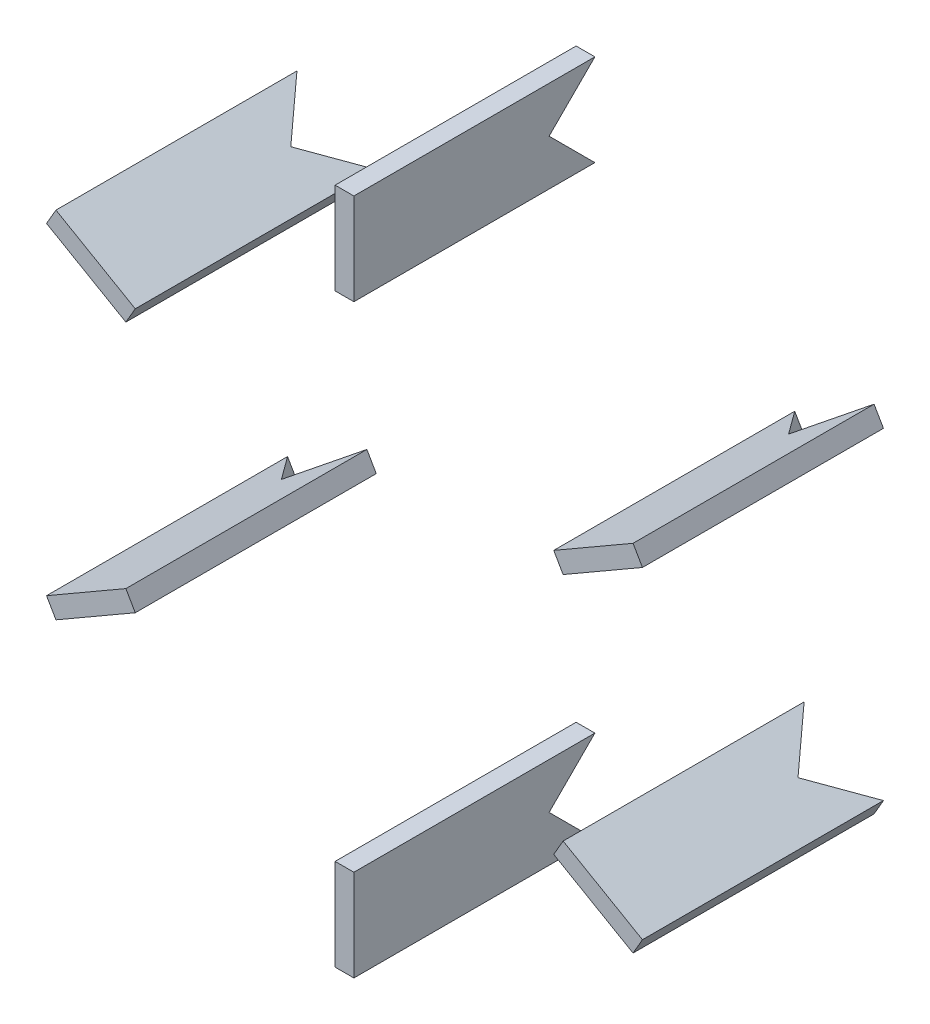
ISO-10303-21;
HEADER;
FILE_DESCRIPTION(('STEP AP214'),'2;1');
FILE_NAME('part.step','',(''),(''),'','','');
FILE_SCHEMA(('AUTOMOTIVE_DESIGN { 1 0 10303 214 1 1 1 1 }'));
ENDSEC;
DATA;
#1=APPLICATION_CONTEXT('core data for automotive mechanical design processes');
#2=APPLICATION_PROTOCOL_DEFINITION('international standard','automotive_design',2000,#1);
#3=PRODUCT_CONTEXT('',#1,'mechanical');
#4=PRODUCT('Part','Part','',(#3));
#5=PRODUCT_RELATED_PRODUCT_CATEGORY('part','',(#4));
#6=PRODUCT_DEFINITION_FORMATION('','',#4);
#7=PRODUCT_DEFINITION_CONTEXT('part definition',#1,'design');
#8=PRODUCT_DEFINITION('design','',#6,#7);
#9=PRODUCT_DEFINITION_SHAPE('','',#8);
#10=(LENGTH_UNIT() NAMED_UNIT(*) SI_UNIT(.MILLI.,.METRE.));
#11=(NAMED_UNIT(*) PLANE_ANGLE_UNIT() SI_UNIT($,.RADIAN.));
#12=(NAMED_UNIT(*) SI_UNIT($,.STERADIAN.) SOLID_ANGLE_UNIT());
#13=UNCERTAINTY_MEASURE_WITH_UNIT(LENGTH_MEASURE(1.E-05),#10,'distance_accuracy_value','');
#14=(GEOMETRIC_REPRESENTATION_CONTEXT(3) GLOBAL_UNCERTAINTY_ASSIGNED_CONTEXT((#13)) GLOBAL_UNIT_ASSIGNED_CONTEXT((#10,
#11,#12)) REPRESENTATION_CONTEXT('',''));
#15=CARTESIAN_POINT('',(0.,0.,0.));
#16=DIRECTION('',(0.,0.,1.));
#17=DIRECTION('',(1.,0.,0.));
#18=AXIS2_PLACEMENT_3D('',#15,#16,#17);
#19=CARTESIAN_POINT('',(0.625,-1.08253175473,0.));
#20=DIRECTION('',(0.50000000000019,-0.866025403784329,0.));
#21=DIRECTION('',(0.866025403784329,0.50000000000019,0.));
#22=AXIS2_PLACEMENT_3D('',#19,#20,#21);
#23=PLANE('',#22);
#24=DIRECTION('',(0.,0.,1.));
#25=VECTOR('',#24,1.);
#26=CARTESIAN_POINT('',(39.682745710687,21.4674682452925,1.895));
#27=LINE('',#26,#25);
#28=CARTESIAN_POINT('',(39.6827457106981,21.4674682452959,33.994));
#29=VERTEX_POINT('',#28);
#30=CARTESIAN_POINT('',(39.682745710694,21.467468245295,1.89499999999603));
#31=VERTEX_POINT('',#30);
#32=EDGE_CURVE('P0_E88',#29,#31,#27,.F.);
#33=ORIENTED_EDGE('',*,*,#32,.F.);
#34=DIRECTION('',(-0.86602540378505,-0.499999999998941,0.));
#35=VECTOR('',#34,1.);
#36=CARTESIAN_POINT('',(39.6827457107,21.4674682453,33.994));
#37=LINE('',#36,#35);
#38=CARTESIAN_POINT('',(29.1172357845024,15.3674682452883,33.994));
#39=VERTEX_POINT('',#38);
#40=EDGE_CURVE('P0_E60',#29,#39,#37,.T.);
#41=ORIENTED_EDGE('',*,*,#40,.T.);
#42=DIRECTION('',(0.,0.,1.));
#43=VECTOR('',#42,1.);
#44=CARTESIAN_POINT('',(29.117235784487,15.3674682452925,33.994));
#45=LINE('',#44,#43);
#46=CARTESIAN_POINT('',(29.1172357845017,15.3674682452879,1.89500000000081));
#47=VERTEX_POINT('',#46);
#48=EDGE_CURVE('P0_E56',#47,#39,#45,.T.);
#49=ORIENTED_EDGE('',*,*,#48,.F.);
#50=DIRECTION('',(0.612372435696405,0.353553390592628,0.707106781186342));
#51=VECTOR('',#50,1.);
#52=CARTESIAN_POINT('',(29.1172357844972,15.3674682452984,1.89500000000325));
#53=LINE('',#52,#51);
#54=CARTESIAN_POINT('',(34.3999907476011,18.4174682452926,7.99500000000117));
#55=VERTEX_POINT('',#54);
#56=EDGE_CURVE('P0_E73',#47,#55,#53,.T.);
#57=ORIENTED_EDGE('',*,*,#56,.T.);
#58=DIRECTION('',(0.612372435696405,0.353553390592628,-0.707106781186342));
#59=VECTOR('',#58,1.);
#60=CARTESIAN_POINT('',(34.3999907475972,18.4174682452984,7.99499999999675));
#61=LINE('',#60,#59);
#62=EDGE_CURVE('P0_E82',#55,#31,#61,.T.);
#63=ORIENTED_EDGE('',*,*,#62,.T.);
#64=EDGE_LOOP('',(#33,#41,#49,#57,#63));
#65=FACE_BOUND('',#64,.T.);
#66=ADVANCED_FACE('P0_F16',(#65),#23,.T.);
#67=CARTESIAN_POINT('',(28.4922357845,16.45,33.994));
#68=DIRECTION('',(-0.866025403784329,-0.50000000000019,0.));
#69=DIRECTION('',(0.50000000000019,-0.866025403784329,0.));
#70=AXIS2_PLACEMENT_3D('',#67,#68,#69);
#71=PLANE('',#70);
#72=DIRECTION('',(0.500000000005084,-0.866025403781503,6.3505624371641E-12));
#73=VECTOR('',#72,1.);
#74=CARTESIAN_POINT('',(27.8672357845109,17.5325317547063,1.89499999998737));
#75=LINE('',#74,#73);
#76=CARTESIAN_POINT('',(27.8672357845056,17.5325317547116,1.89499999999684));
#77=VERTEX_POINT('',#76);
#78=EDGE_CURVE('P0_E76',#77,#47,#75,.T.);
#79=ORIENTED_EDGE('',*,*,#78,.T.);
#80=ORIENTED_EDGE('',*,*,#48,.T.);
#81=DIRECTION('',(-0.500000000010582,0.866025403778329,0.));
#82=VECTOR('',#81,1.);
#83=CARTESIAN_POINT('',(29.1172357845,15.3674682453,33.994));
#84=LINE('',#83,#82);
#85=CARTESIAN_POINT('',(27.8672357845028,17.5325317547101,33.994));
#86=VERTEX_POINT('',#85);
#87=EDGE_CURVE('P0_E93',#39,#86,#84,.T.);
#88=ORIENTED_EDGE('',*,*,#87,.T.);
#89=DIRECTION('',(0.,0.,1.));
#90=VECTOR('',#89,1.);
#91=CARTESIAN_POINT('',(27.8672357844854,17.5325317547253,0.));
#92=LINE('',#91,#90);
#93=EDGE_CURVE('P0_E20',#86,#77,#92,.F.);
#94=ORIENTED_EDGE('',*,*,#93,.T.);
#95=EDGE_LOOP('',(#79,#80,#88,#94));
#96=FACE_BOUND('',#95,.T.);
#97=ADVANCED_FACE('P0_F81',(#96),#71,.T.);
#98=CARTESIAN_POINT('',(33.7749907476,19.5,7.995));
#99=DIRECTION('',(-0.612372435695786,-0.353553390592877,0.707106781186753));
#100=DIRECTION('',(0.755928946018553,0.,0.654653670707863));
#101=AXIS2_PLACEMENT_3D('',#98,#99,#100);
#102=PLANE('',#101);
#103=DIRECTION('',(0.612372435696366,0.353553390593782,0.707106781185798));
#104=VECTOR('',#103,1.);
#105=CARTESIAN_POINT('',(27.8672357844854,17.5325317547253,1.895));
#106=LINE('',#105,#104);
#107=CARTESIAN_POINT('',(33.1499907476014,20.5825317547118,7.99499999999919));
#108=VERTEX_POINT('',#107);
#109=EDGE_CURVE('P0_E100',#77,#108,#106,.T.);
#110=ORIENTED_EDGE('',*,*,#109,.T.);
#111=DIRECTION('',(0.500000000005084,-0.866025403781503,-6.3504757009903E-12));
#112=VECTOR('',#111,1.);
#113=CARTESIAN_POINT('',(33.1499907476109,20.5825317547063,7.99500000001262));
#114=LINE('',#113,#112);
#115=EDGE_CURVE('P0_E77',#108,#55,#114,.T.);
#116=ORIENTED_EDGE('',*,*,#115,.T.);
#117=ORIENTED_EDGE('',*,*,#56,.F.);
#118=ORIENTED_EDGE('',*,*,#78,.F.);
#119=EDGE_LOOP('',(#110,#116,#117,#118));
#120=FACE_BOUND('',#119,.T.);
#121=ADVANCED_FACE('P0_F75',(#120),#102,.F.);
#122=CARTESIAN_POINT('',(39.0577457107,22.55,1.895));
#123=DIRECTION('',(0.612372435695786,0.353553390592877,0.707106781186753));
#124=DIRECTION('',(0.755928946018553,0.,-0.654653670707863));
#125=AXIS2_PLACEMENT_3D('',#122,#123,#124);
#126=PLANE('',#125);
#127=DIRECTION('',(0.612372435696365,0.353553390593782,-0.707106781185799));
#128=VECTOR('',#127,1.);
#129=CARTESIAN_POINT('',(33.149990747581,20.5825317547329,7.995));
#130=LINE('',#129,#128);
#131=CARTESIAN_POINT('',(38.4327457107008,23.632531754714,1.89500000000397));
#132=VERTEX_POINT('',#131);
#133=EDGE_CURVE('P0_E98',#108,#132,#130,.T.);
#134=ORIENTED_EDGE('',*,*,#133,.T.);
#135=DIRECTION('',(-0.50000000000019,0.866025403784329,0.));
#136=VECTOR('',#135,1.);
#137=CARTESIAN_POINT('',(39.0577457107,22.55,1.895));
#138=LINE('',#137,#136);
#139=EDGE_CURVE('P0_E86',#31,#132,#138,.T.);
#140=ORIENTED_EDGE('',*,*,#139,.F.);
#141=ORIENTED_EDGE('',*,*,#62,.F.);
#142=ORIENTED_EDGE('',*,*,#115,.F.);
#143=EDGE_LOOP('',(#134,#140,#141,#142));
#144=FACE_BOUND('',#143,.T.);
#145=ADVANCED_FACE('P0_F105',(#144),#126,.F.);
#146=CARTESIAN_POINT('',(39.0577457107,22.55,1.895));
#147=DIRECTION('',(0.866025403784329,0.50000000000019,0.));
#148=DIRECTION('',(-0.50000000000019,0.866025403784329,0.));
#149=AXIS2_PLACEMENT_3D('',#146,#147,#148);
#150=PLANE('',#149);
#151=DIRECTION('',(0.500000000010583,-0.866025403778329,0.));
#152=VECTOR('',#151,1.);
#153=CARTESIAN_POINT('',(38.4327457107,23.6325317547,33.994));
#154=LINE('',#153,#152);
#155=CARTESIAN_POINT('',(38.4327457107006,23.6325317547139,33.994));
#156=VERTEX_POINT('',#155);
#157=EDGE_CURVE('P0_E34',#156,#29,#154,.T.);
#158=ORIENTED_EDGE('',*,*,#157,.T.);
#159=ORIENTED_EDGE('',*,*,#32,.T.);
#160=ORIENTED_EDGE('',*,*,#139,.T.);
#161=DIRECTION('',(0.,0.,1.));
#162=VECTOR('',#161,1.);
#163=CARTESIAN_POINT('',(38.4327457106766,23.6325317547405,0.));
#164=LINE('',#163,#162);
#165=EDGE_CURVE('P0_E26',#132,#156,#164,.T.);
#166=ORIENTED_EDGE('',*,*,#165,.T.);
#167=EDGE_LOOP('',(#158,#159,#160,#166));
#168=FACE_BOUND('',#167,.T.);
#169=ADVANCED_FACE('P0_F107',(#168),#150,.T.);
#170=CARTESIAN_POINT('',(0.,32.9,33.994));
#171=DIRECTION('',(0.,0.,-1.));
#172=DIRECTION('',(-1.,0.,0.));
#173=AXIS2_PLACEMENT_3D('',#170,#171,#172);
#174=PLANE('',#173);
#175=DIRECTION('',(0.866025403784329,0.50000000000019,0.));
#176=VECTOR('',#175,1.);
#177=CARTESIAN_POINT('',(-0.625,1.08253175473,33.994));
#178=LINE('',#177,#176);
#179=EDGE_CURVE('P0_E11',#156,#86,#178,.F.);
#180=ORIENTED_EDGE('',*,*,#179,.T.);
#181=ORIENTED_EDGE('',*,*,#87,.F.);
#182=ORIENTED_EDGE('',*,*,#40,.F.);
#183=ORIENTED_EDGE('',*,*,#157,.F.);
#184=EDGE_LOOP('',(#180,#181,#182,#183));
#185=FACE_BOUND('',#184,.T.);
#186=ADVANCED_FACE('P0_F109',(#185),#174,.F.);
#187=CARTESIAN_POINT('',(-0.625,1.08253175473,0.));
#188=DIRECTION('',(0.50000000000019,-0.866025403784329,0.));
#189=DIRECTION('',(0.866025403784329,0.50000000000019,0.));
#190=AXIS2_PLACEMENT_3D('',#187,#188,#189);
#191=PLANE('',#190);
#192=ORIENTED_EDGE('',*,*,#165,.F.);
#193=ORIENTED_EDGE('',*,*,#133,.F.);
#194=ORIENTED_EDGE('',*,*,#109,.F.);
#195=ORIENTED_EDGE('',*,*,#93,.F.);
#196=ORIENTED_EDGE('',*,*,#179,.F.);
#197=EDGE_LOOP('',(#192,#193,#194,#195,#196));
#198=FACE_BOUND('',#197,.T.);
#199=ADVANCED_FACE('P0_F18',(#198),#191,.F.);
#200=CLOSED_SHELL('',(#66,#97,#121,#145,#169,#186,#199));
#201=MANIFOLD_SOLID_BREP('P0_B1',#200);
#202=CARTESIAN_POINT('',(0.625,1.08253175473,0.));
#203=DIRECTION('',(-0.50000000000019,-0.866025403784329,0.));
#204=DIRECTION('',(0.866025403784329,-0.50000000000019,0.));
#205=AXIS2_PLACEMENT_3D('',#202,#203,#204);
#206=PLANE('',#205);
#207=DIRECTION('',(0.,0.,1.));
#208=VECTOR('',#207,1.);
#209=CARTESIAN_POINT('',(39.682745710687,-21.4674682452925,1.895));
#210=LINE('',#209,#208);
#211=CARTESIAN_POINT('',(39.682745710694,-21.467468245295,1.89499999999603));
#212=VERTEX_POINT('',#211);
#213=CARTESIAN_POINT('',(39.6827457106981,-21.4674682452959,33.994));
#214=VERTEX_POINT('',#213);
#215=EDGE_CURVE('P1_E91',#212,#214,#210,.T.);
#216=ORIENTED_EDGE('',*,*,#215,.F.);
#217=DIRECTION('',(-0.612372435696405,0.353553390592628,0.707106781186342));
#218=VECTOR('',#217,1.);
#219=CARTESIAN_POINT('',(39.6827457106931,-21.467468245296,1.89499999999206));
#220=LINE('',#219,#218);
#221=CARTESIAN_POINT('',(34.3999907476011,-18.4174682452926,7.99500000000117));
#222=VERTEX_POINT('',#221);
#223=EDGE_CURVE('P1_E72',#212,#222,#220,.T.);
#224=ORIENTED_EDGE('',*,*,#223,.T.);
#225=DIRECTION('',(-0.612372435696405,0.353553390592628,-0.707106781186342));
#226=VECTOR('',#225,1.);
#227=CARTESIAN_POINT('',(34.3999907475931,-18.417468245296,7.99500000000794));
#228=LINE('',#227,#226);
#229=CARTESIAN_POINT('',(29.1172357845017,-15.3674682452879,1.89500000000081));
#230=VERTEX_POINT('',#229);
#231=EDGE_CURVE('P1_E69',#222,#230,#228,.T.);
#232=ORIENTED_EDGE('',*,*,#231,.T.);
#233=DIRECTION('',(0.,0.,1.));
#234=VECTOR('',#233,1.);
#235=CARTESIAN_POINT('',(29.117235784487,-15.3674682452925,33.994));
#236=LINE('',#235,#234);
#237=CARTESIAN_POINT('',(29.1172357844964,-15.3674682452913,33.994));
#238=VERTEX_POINT('',#237);
#239=EDGE_CURVE('P1_E71',#238,#230,#236,.F.);
#240=ORIENTED_EDGE('',*,*,#239,.F.);
#241=DIRECTION('',(0.86602540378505,-0.499999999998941,0.));
#242=VECTOR('',#241,1.);
#243=CARTESIAN_POINT('',(29.1172357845,-15.3674682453,33.994));
#244=LINE('',#243,#242);
#245=EDGE_CURVE('P1_E58',#238,#214,#244,.T.);
#246=ORIENTED_EDGE('',*,*,#245,.T.);
#247=EDGE_LOOP('',(#216,#224,#232,#240,#246));
#248=FACE_BOUND('',#247,.T.);
#249=ADVANCED_FACE('P1_F16',(#248),#206,.F.);
#250=CARTESIAN_POINT('',(28.4922357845,-16.45,33.994));
#251=DIRECTION('',(-0.866025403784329,0.50000000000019,0.));
#252=DIRECTION('',(-0.50000000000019,-0.866025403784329,0.));
#253=AXIS2_PLACEMENT_3D('',#250,#251,#252);
#254=PLANE('',#253);
#255=DIRECTION('',(-0.500000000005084,-0.866025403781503,-6.3505624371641E-12));
#256=VECTOR('',#255,1.);
#257=CARTESIAN_POINT('',(29.1172357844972,-15.3674682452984,1.89500000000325));
#258=LINE('',#257,#256);
#259=CARTESIAN_POINT('',(27.8672357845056,-17.5325317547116,1.89499999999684));
#260=VERTEX_POINT('',#259);
#261=EDGE_CURVE('P1_E76',#230,#260,#258,.T.);
#262=ORIENTED_EDGE('',*,*,#261,.T.);
#263=DIRECTION('',(0.,0.,1.));
#264=VECTOR('',#263,1.);
#265=CARTESIAN_POINT('',(27.8672357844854,-17.5325317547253,0.));
#266=LINE('',#265,#264);
#267=CARTESIAN_POINT('',(27.8672357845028,-17.5325317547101,33.994));
#268=VERTEX_POINT('',#267);
#269=EDGE_CURVE('P1_E20',#268,#260,#266,.F.);
#270=ORIENTED_EDGE('',*,*,#269,.F.);
#271=DIRECTION('',(0.500000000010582,0.866025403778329,0.));
#272=VECTOR('',#271,1.);
#273=CARTESIAN_POINT('',(27.8672357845,-17.5325317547,33.994));
#274=LINE('',#273,#272);
#275=EDGE_CURVE('P1_E80',#268,#238,#274,.T.);
#276=ORIENTED_EDGE('',*,*,#275,.T.);
#277=ORIENTED_EDGE('',*,*,#239,.T.);
#278=EDGE_LOOP('',(#262,#270,#276,#277));
#279=FACE_BOUND('',#278,.T.);
#280=ADVANCED_FACE('P1_F78',(#279),#254,.T.);
#281=CARTESIAN_POINT('',(33.7749907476,-19.5,7.995));
#282=DIRECTION('',(-0.612372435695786,0.353553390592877,0.707106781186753));
#283=DIRECTION('',(0.755928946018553,0.,0.654653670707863));
#284=AXIS2_PLACEMENT_3D('',#281,#282,#283);
#285=PLANE('',#284);
#286=ORIENTED_EDGE('',*,*,#231,.F.);
#287=DIRECTION('',(-0.500000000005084,-0.866025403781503,6.3504757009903E-12));
#288=VECTOR('',#287,1.);
#289=CARTESIAN_POINT('',(34.3999907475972,-18.4174682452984,7.99499999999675));
#290=LINE('',#289,#288);
#291=CARTESIAN_POINT('',(33.1499907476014,-20.5825317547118,7.99499999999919));
#292=VERTEX_POINT('',#291);
#293=EDGE_CURVE('P1_E86',#222,#292,#290,.T.);
#294=ORIENTED_EDGE('',*,*,#293,.T.);
#295=DIRECTION('',(0.612372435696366,-0.353553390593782,0.707106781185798));
#296=VECTOR('',#295,1.);
#297=CARTESIAN_POINT('',(27.8672357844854,-17.5325317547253,1.895));
#298=LINE('',#297,#296);
#299=EDGE_CURVE('P1_E84',#260,#292,#298,.T.);
#300=ORIENTED_EDGE('',*,*,#299,.F.);
#301=ORIENTED_EDGE('',*,*,#261,.F.);
#302=EDGE_LOOP('',(#286,#294,#300,#301));
#303=FACE_BOUND('',#302,.T.);
#304=ADVANCED_FACE('P1_F82',(#303),#285,.F.);
#305=CARTESIAN_POINT('',(39.0577457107,-22.55,1.895));
#306=DIRECTION('',(0.612372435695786,-0.353553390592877,0.707106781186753));
#307=DIRECTION('',(0.755928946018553,0.,-0.654653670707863));
#308=AXIS2_PLACEMENT_3D('',#305,#306,#307);
#309=PLANE('',#308);
#310=ORIENTED_EDGE('',*,*,#223,.F.);
#311=DIRECTION('',(0.50000000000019,0.866025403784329,0.));
#312=VECTOR('',#311,1.);
#313=CARTESIAN_POINT('',(39.0577457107,-22.55,1.895));
#314=LINE('',#313,#312);
#315=CARTESIAN_POINT('',(38.4327457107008,-23.632531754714,1.89500000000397));
#316=VERTEX_POINT('',#315);
#317=EDGE_CURVE('P1_E89',#316,#212,#314,.T.);
#318=ORIENTED_EDGE('',*,*,#317,.F.);
#319=DIRECTION('',(0.612372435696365,-0.353553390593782,-0.707106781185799));
#320=VECTOR('',#319,1.);
#321=CARTESIAN_POINT('',(33.149990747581,-20.5825317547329,7.995));
#322=LINE('',#321,#320);
#323=EDGE_CURVE('P1_E100',#292,#316,#322,.T.);
#324=ORIENTED_EDGE('',*,*,#323,.F.);
#325=ORIENTED_EDGE('',*,*,#293,.F.);
#326=EDGE_LOOP('',(#310,#318,#324,#325));
#327=FACE_BOUND('',#326,.T.);
#328=ADVANCED_FACE('P1_F112',(#327),#309,.F.);
#329=CARTESIAN_POINT('',(39.0577457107,-22.55,1.895));
#330=DIRECTION('',(0.866025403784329,-0.50000000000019,0.));
#331=DIRECTION('',(0.50000000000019,0.866025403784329,0.));
#332=AXIS2_PLACEMENT_3D('',#329,#330,#331);
#333=PLANE('',#332);
#334=DIRECTION('',(-0.500000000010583,-0.866025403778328,0.));
#335=VECTOR('',#334,1.);
#336=CARTESIAN_POINT('',(39.6827457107,-21.4674682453,33.994));
#337=LINE('',#336,#335);
#338=CARTESIAN_POINT('',(38.4327457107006,-23.6325317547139,33.994));
#339=VERTEX_POINT('',#338);
#340=EDGE_CURVE('P1_E35',#214,#339,#337,.T.);
#341=ORIENTED_EDGE('',*,*,#340,.T.);
#342=DIRECTION('',(0.,0.,1.));
#343=VECTOR('',#342,1.);
#344=CARTESIAN_POINT('',(38.4327457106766,-23.6325317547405,0.));
#345=LINE('',#344,#343);
#346=EDGE_CURVE('P1_E26',#316,#339,#345,.T.);
#347=ORIENTED_EDGE('',*,*,#346,.F.);
#348=ORIENTED_EDGE('',*,*,#317,.T.);
#349=ORIENTED_EDGE('',*,*,#215,.T.);
#350=EDGE_LOOP('',(#341,#347,#348,#349));
#351=FACE_BOUND('',#350,.T.);
#352=ADVANCED_FACE('P1_F106',(#351),#333,.T.);
#353=CARTESIAN_POINT('',(0.,32.9,33.994));
#354=DIRECTION('',(0.,0.,-1.));
#355=DIRECTION('',(-1.,0.,0.));
#356=AXIS2_PLACEMENT_3D('',#353,#354,#355);
#357=PLANE('',#356);
#358=ORIENTED_EDGE('',*,*,#245,.F.);
#359=ORIENTED_EDGE('',*,*,#275,.F.);
#360=DIRECTION('',(0.866025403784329,-0.50000000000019,0.));
#361=VECTOR('',#360,1.);
#362=CARTESIAN_POINT('',(-0.625,-1.08253175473,33.994));
#363=LINE('',#362,#361);
#364=EDGE_CURVE('P1_E11',#339,#268,#363,.F.);
#365=ORIENTED_EDGE('',*,*,#364,.F.);
#366=ORIENTED_EDGE('',*,*,#340,.F.);
#367=EDGE_LOOP('',(#358,#359,#365,#366));
#368=FACE_BOUND('',#367,.T.);
#369=ADVANCED_FACE('P1_F104',(#368),#357,.F.);
#370=CARTESIAN_POINT('',(-0.625,-1.08253175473,0.));
#371=DIRECTION('',(-0.50000000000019,-0.866025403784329,0.));
#372=DIRECTION('',(0.866025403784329,-0.50000000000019,0.));
#373=AXIS2_PLACEMENT_3D('',#370,#371,#372);
#374=PLANE('',#373);
#375=ORIENTED_EDGE('',*,*,#346,.T.);
#376=ORIENTED_EDGE('',*,*,#364,.T.);
#377=ORIENTED_EDGE('',*,*,#269,.T.);
#378=ORIENTED_EDGE('',*,*,#299,.T.);
#379=ORIENTED_EDGE('',*,*,#323,.T.);
#380=EDGE_LOOP('',(#375,#376,#377,#378,#379));
#381=FACE_BOUND('',#380,.T.);
#382=ADVANCED_FACE('P1_F18',(#381),#374,.T.);
#383=CLOSED_SHELL('',(#249,#280,#304,#328,#352,#369,#382));
#384=MANIFOLD_SOLID_BREP('P1_B1',#383);
#385=CARTESIAN_POINT('',(-0.625,1.08253175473,0.));
#386=DIRECTION('',(-0.50000000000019,0.866025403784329,0.));
#387=DIRECTION('',(-0.866025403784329,-0.50000000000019,0.));
#388=AXIS2_PLACEMENT_3D('',#385,#386,#387);
#389=PLANE('',#388);
#390=DIRECTION('',(0.,0.,1.));
#391=VECTOR('',#390,1.);
#392=CARTESIAN_POINT('',(-39.682745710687,-21.4674682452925,1.895));
#393=LINE('',#392,#391);
#394=CARTESIAN_POINT('',(-39.6827457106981,-21.4674682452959,33.994));
#395=VERTEX_POINT('',#394);
#396=CARTESIAN_POINT('',(-39.682745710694,-21.467468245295,1.89499999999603));
#397=VERTEX_POINT('',#396);
#398=EDGE_CURVE('P2_E88',#395,#397,#393,.F.);
#399=ORIENTED_EDGE('',*,*,#398,.F.);
#400=DIRECTION('',(0.86602540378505,0.499999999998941,0.));
#401=VECTOR('',#400,1.);
#402=CARTESIAN_POINT('',(-39.6827457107,-21.4674682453,33.994));
#403=LINE('',#402,#401);
#404=CARTESIAN_POINT('',(-29.1172357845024,-15.3674682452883,33.994));
#405=VERTEX_POINT('',#404);
#406=EDGE_CURVE('P2_E60',#395,#405,#403,.T.);
#407=ORIENTED_EDGE('',*,*,#406,.T.);
#408=DIRECTION('',(0.,0.,1.));
#409=VECTOR('',#408,1.);
#410=CARTESIAN_POINT('',(-29.117235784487,-15.3674682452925,33.994));
#411=LINE('',#410,#409);
#412=CARTESIAN_POINT('',(-29.1172357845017,-15.3674682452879,1.89500000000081));
#413=VERTEX_POINT('',#412);
#414=EDGE_CURVE('P2_E56',#413,#405,#411,.T.);
#415=ORIENTED_EDGE('',*,*,#414,.F.);
#416=DIRECTION('',(-0.612372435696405,-0.353553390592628,0.707106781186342));
#417=VECTOR('',#416,1.);
#418=CARTESIAN_POINT('',(-29.1172357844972,-15.3674682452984,1.89500000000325));
#419=LINE('',#418,#417);
#420=CARTESIAN_POINT('',(-34.3999907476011,-18.4174682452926,7.99500000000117));
#421=VERTEX_POINT('',#420);
#422=EDGE_CURVE('P2_E73',#413,#421,#419,.T.);
#423=ORIENTED_EDGE('',*,*,#422,.T.);
#424=DIRECTION('',(-0.612372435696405,-0.353553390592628,-0.707106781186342));
#425=VECTOR('',#424,1.);
#426=CARTESIAN_POINT('',(-34.3999907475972,-18.4174682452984,7.99499999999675));
#427=LINE('',#426,#425);
#428=EDGE_CURVE('P2_E82',#421,#397,#427,.T.);
#429=ORIENTED_EDGE('',*,*,#428,.T.);
#430=EDGE_LOOP('',(#399,#407,#415,#423,#429));
#431=FACE_BOUND('',#430,.T.);
#432=ADVANCED_FACE('P2_F16',(#431),#389,.T.);
#433=CARTESIAN_POINT('',(-28.4922357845,-16.45,33.994));
#434=DIRECTION('',(0.866025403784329,0.50000000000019,0.));
#435=DIRECTION('',(-0.50000000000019,0.866025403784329,0.));
#436=AXIS2_PLACEMENT_3D('',#433,#434,#435);
#437=PLANE('',#436);
#438=DIRECTION('',(-0.500000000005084,0.866025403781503,6.3505624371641E-12));
#439=VECTOR('',#438,1.);
#440=CARTESIAN_POINT('',(-27.8672357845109,-17.5325317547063,1.89499999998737));
#441=LINE('',#440,#439);
#442=CARTESIAN_POINT('',(-27.8672357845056,-17.5325317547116,1.89499999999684));
#443=VERTEX_POINT('',#442);
#444=EDGE_CURVE('P2_E76',#443,#413,#441,.T.);
#445=ORIENTED_EDGE('',*,*,#444,.T.);
#446=ORIENTED_EDGE('',*,*,#414,.T.);
#447=DIRECTION('',(0.500000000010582,-0.866025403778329,0.));
#448=VECTOR('',#447,1.);
#449=CARTESIAN_POINT('',(-29.1172357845,-15.3674682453,33.994));
#450=LINE('',#449,#448);
#451=CARTESIAN_POINT('',(-27.8672357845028,-17.5325317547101,33.994));
#452=VERTEX_POINT('',#451);
#453=EDGE_CURVE('P2_E93',#405,#452,#450,.T.);
#454=ORIENTED_EDGE('',*,*,#453,.T.);
#455=DIRECTION('',(0.,0.,1.));
#456=VECTOR('',#455,1.);
#457=CARTESIAN_POINT('',(-27.8672357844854,-17.5325317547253,0.));
#458=LINE('',#457,#456);
#459=EDGE_CURVE('P2_E20',#452,#443,#458,.F.);
#460=ORIENTED_EDGE('',*,*,#459,.T.);
#461=EDGE_LOOP('',(#445,#446,#454,#460));
#462=FACE_BOUND('',#461,.T.);
#463=ADVANCED_FACE('P2_F81',(#462),#437,.T.);
#464=CARTESIAN_POINT('',(-33.7749907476,-19.5,7.995));
#465=DIRECTION('',(0.612372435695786,0.353553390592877,0.707106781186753));
#466=DIRECTION('',(0.755928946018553,0.,-0.654653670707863));
#467=AXIS2_PLACEMENT_3D('',#464,#465,#466);
#468=PLANE('',#467);
#469=DIRECTION('',(-0.612372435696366,-0.353553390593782,0.707106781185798));
#470=VECTOR('',#469,1.);
#471=CARTESIAN_POINT('',(-27.8672357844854,-17.5325317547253,1.895));
#472=LINE('',#471,#470);
#473=CARTESIAN_POINT('',(-33.1499907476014,-20.5825317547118,7.99499999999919));
#474=VERTEX_POINT('',#473);
#475=EDGE_CURVE('P2_E100',#443,#474,#472,.T.);
#476=ORIENTED_EDGE('',*,*,#475,.T.);
#477=DIRECTION('',(-0.500000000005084,0.866025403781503,-6.3504757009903E-12));
#478=VECTOR('',#477,1.);
#479=CARTESIAN_POINT('',(-33.1499907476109,-20.5825317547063,7.99500000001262));
#480=LINE('',#479,#478);
#481=EDGE_CURVE('P2_E77',#474,#421,#480,.T.);
#482=ORIENTED_EDGE('',*,*,#481,.T.);
#483=ORIENTED_EDGE('',*,*,#422,.F.);
#484=ORIENTED_EDGE('',*,*,#444,.F.);
#485=EDGE_LOOP('',(#476,#482,#483,#484));
#486=FACE_BOUND('',#485,.T.);
#487=ADVANCED_FACE('P2_F75',(#486),#468,.F.);
#488=CARTESIAN_POINT('',(-39.0577457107,-22.55,1.895));
#489=DIRECTION('',(-0.612372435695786,-0.353553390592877,0.707106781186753));
#490=DIRECTION('',(0.755928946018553,0.,0.654653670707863));
#491=AXIS2_PLACEMENT_3D('',#488,#489,#490);
#492=PLANE('',#491);
#493=DIRECTION('',(-0.612372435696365,-0.353553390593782,-0.707106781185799));
#494=VECTOR('',#493,1.);
#495=CARTESIAN_POINT('',(-33.149990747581,-20.5825317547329,7.995));
#496=LINE('',#495,#494);
#497=CARTESIAN_POINT('',(-38.4327457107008,-23.632531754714,1.89500000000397));
#498=VERTEX_POINT('',#497);
#499=EDGE_CURVE('P2_E98',#474,#498,#496,.T.);
#500=ORIENTED_EDGE('',*,*,#499,.T.);
#501=DIRECTION('',(0.50000000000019,-0.866025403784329,0.));
#502=VECTOR('',#501,1.);
#503=CARTESIAN_POINT('',(-39.0577457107,-22.55,1.895));
#504=LINE('',#503,#502);
#505=EDGE_CURVE('P2_E86',#397,#498,#504,.T.);
#506=ORIENTED_EDGE('',*,*,#505,.F.);
#507=ORIENTED_EDGE('',*,*,#428,.F.);
#508=ORIENTED_EDGE('',*,*,#481,.F.);
#509=EDGE_LOOP('',(#500,#506,#507,#508));
#510=FACE_BOUND('',#509,.T.);
#511=ADVANCED_FACE('P2_F105',(#510),#492,.F.);
#512=CARTESIAN_POINT('',(-39.0577457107,-22.55,1.895));
#513=DIRECTION('',(-0.866025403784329,-0.50000000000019,0.));
#514=DIRECTION('',(0.50000000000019,-0.866025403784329,0.));
#515=AXIS2_PLACEMENT_3D('',#512,#513,#514);
#516=PLANE('',#515);
#517=DIRECTION('',(-0.500000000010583,0.866025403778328,0.));
#518=VECTOR('',#517,1.);
#519=CARTESIAN_POINT('',(-38.4327457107,-23.6325317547,33.994));
#520=LINE('',#519,#518);
#521=CARTESIAN_POINT('',(-38.4327457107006,-23.6325317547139,33.994));
#522=VERTEX_POINT('',#521);
#523=EDGE_CURVE('P2_E34',#522,#395,#520,.T.);
#524=ORIENTED_EDGE('',*,*,#523,.T.);
#525=ORIENTED_EDGE('',*,*,#398,.T.);
#526=ORIENTED_EDGE('',*,*,#505,.T.);
#527=DIRECTION('',(0.,0.,1.));
#528=VECTOR('',#527,1.);
#529=CARTESIAN_POINT('',(-38.4327457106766,-23.6325317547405,0.));
#530=LINE('',#529,#528);
#531=EDGE_CURVE('P2_E26',#498,#522,#530,.T.);
#532=ORIENTED_EDGE('',*,*,#531,.T.);
#533=EDGE_LOOP('',(#524,#525,#526,#532));
#534=FACE_BOUND('',#533,.T.);
#535=ADVANCED_FACE('P2_F107',(#534),#516,.T.);
#536=CARTESIAN_POINT('',(0.,32.9,33.994));
#537=DIRECTION('',(0.,0.,-1.));
#538=DIRECTION('',(-1.,0.,0.));
#539=AXIS2_PLACEMENT_3D('',#536,#537,#538);
#540=PLANE('',#539);
#541=DIRECTION('',(-0.866025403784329,-0.50000000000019,0.));
#542=VECTOR('',#541,1.);
#543=CARTESIAN_POINT('',(0.625,-1.08253175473,33.994));
#544=LINE('',#543,#542);
#545=EDGE_CURVE('P2_E11',#522,#452,#544,.F.);
#546=ORIENTED_EDGE('',*,*,#545,.T.);
#547=ORIENTED_EDGE('',*,*,#453,.F.);
#548=ORIENTED_EDGE('',*,*,#406,.F.);
#549=ORIENTED_EDGE('',*,*,#523,.F.);
#550=EDGE_LOOP('',(#546,#547,#548,#549));
#551=FACE_BOUND('',#550,.T.);
#552=ADVANCED_FACE('P2_F109',(#551),#540,.F.);
#553=CARTESIAN_POINT('',(0.625,-1.08253175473,0.));
#554=DIRECTION('',(-0.50000000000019,0.866025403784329,0.));
#555=DIRECTION('',(-0.866025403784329,-0.50000000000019,0.));
#556=AXIS2_PLACEMENT_3D('',#553,#554,#555);
#557=PLANE('',#556);
#558=ORIENTED_EDGE('',*,*,#531,.F.);
#559=ORIENTED_EDGE('',*,*,#499,.F.);
#560=ORIENTED_EDGE('',*,*,#475,.F.);
#561=ORIENTED_EDGE('',*,*,#459,.F.);
#562=ORIENTED_EDGE('',*,*,#545,.F.);
#563=EDGE_LOOP('',(#558,#559,#560,#561,#562));
#564=FACE_BOUND('',#563,.T.);
#565=ADVANCED_FACE('P2_F18',(#564),#557,.F.);
#566=CLOSED_SHELL('',(#432,#463,#487,#511,#535,#552,#565));
#567=MANIFOLD_SOLID_BREP('P2_B1',#566);
#568=CARTESIAN_POINT('',(-0.625,-1.08253175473,0.));
#569=DIRECTION('',(0.50000000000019,0.866025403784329,0.));
#570=DIRECTION('',(-0.866025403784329,0.50000000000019,0.));
#571=AXIS2_PLACEMENT_3D('',#568,#569,#570);
#572=PLANE('',#571);
#573=DIRECTION('',(0.,0.,1.));
#574=VECTOR('',#573,1.);
#575=CARTESIAN_POINT('',(-39.682745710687,21.4674682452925,1.895));
#576=LINE('',#575,#574);
#577=CARTESIAN_POINT('',(-39.682745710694,21.467468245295,1.89499999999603));
#578=VERTEX_POINT('',#577);
#579=CARTESIAN_POINT('',(-39.6827457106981,21.4674682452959,33.994));
#580=VERTEX_POINT('',#579);
#581=EDGE_CURVE('P3_E91',#578,#580,#576,.T.);
#582=ORIENTED_EDGE('',*,*,#581,.F.);
#583=DIRECTION('',(0.612372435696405,-0.353553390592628,0.707106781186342));
#584=VECTOR('',#583,1.);
#585=CARTESIAN_POINT('',(-39.6827457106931,21.467468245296,1.89499999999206));
#586=LINE('',#585,#584);
#587=CARTESIAN_POINT('',(-34.3999907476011,18.4174682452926,7.99500000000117));
#588=VERTEX_POINT('',#587);
#589=EDGE_CURVE('P3_E72',#578,#588,#586,.T.);
#590=ORIENTED_EDGE('',*,*,#589,.T.);
#591=DIRECTION('',(0.612372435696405,-0.353553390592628,-0.707106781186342));
#592=VECTOR('',#591,1.);
#593=CARTESIAN_POINT('',(-34.3999907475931,18.417468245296,7.99500000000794));
#594=LINE('',#593,#592);
#595=CARTESIAN_POINT('',(-29.1172357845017,15.3674682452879,1.89500000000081));
#596=VERTEX_POINT('',#595);
#597=EDGE_CURVE('P3_E69',#588,#596,#594,.T.);
#598=ORIENTED_EDGE('',*,*,#597,.T.);
#599=DIRECTION('',(0.,0.,1.));
#600=VECTOR('',#599,1.);
#601=CARTESIAN_POINT('',(-29.117235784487,15.3674682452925,33.994));
#602=LINE('',#601,#600);
#603=CARTESIAN_POINT('',(-29.1172357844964,15.3674682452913,33.994));
#604=VERTEX_POINT('',#603);
#605=EDGE_CURVE('P3_E71',#604,#596,#602,.F.);
#606=ORIENTED_EDGE('',*,*,#605,.F.);
#607=DIRECTION('',(-0.86602540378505,0.499999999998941,0.));
#608=VECTOR('',#607,1.);
#609=CARTESIAN_POINT('',(-29.1172357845,15.3674682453,33.994));
#610=LINE('',#609,#608);
#611=EDGE_CURVE('P3_E58',#604,#580,#610,.T.);
#612=ORIENTED_EDGE('',*,*,#611,.T.);
#613=EDGE_LOOP('',(#582,#590,#598,#606,#612));
#614=FACE_BOUND('',#613,.T.);
#615=ADVANCED_FACE('P3_F16',(#614),#572,.F.);
#616=CARTESIAN_POINT('',(-28.4922357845,16.45,33.994));
#617=DIRECTION('',(0.866025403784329,-0.50000000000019,0.));
#618=DIRECTION('',(0.50000000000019,0.866025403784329,0.));
#619=AXIS2_PLACEMENT_3D('',#616,#617,#618);
#620=PLANE('',#619);
#621=DIRECTION('',(0.500000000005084,0.866025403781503,-6.3505624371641E-12));
#622=VECTOR('',#621,1.);
#623=CARTESIAN_POINT('',(-29.1172357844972,15.3674682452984,1.89500000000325));
#624=LINE('',#623,#622);
#625=CARTESIAN_POINT('',(-27.8672357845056,17.5325317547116,1.89499999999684));
#626=VERTEX_POINT('',#625);
#627=EDGE_CURVE('P3_E76',#596,#626,#624,.T.);
#628=ORIENTED_EDGE('',*,*,#627,.T.);
#629=DIRECTION('',(0.,0.,1.));
#630=VECTOR('',#629,1.);
#631=CARTESIAN_POINT('',(-27.8672357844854,17.5325317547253,0.));
#632=LINE('',#631,#630);
#633=CARTESIAN_POINT('',(-27.8672357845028,17.5325317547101,33.994));
#634=VERTEX_POINT('',#633);
#635=EDGE_CURVE('P3_E20',#634,#626,#632,.F.);
#636=ORIENTED_EDGE('',*,*,#635,.F.);
#637=DIRECTION('',(-0.500000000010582,-0.866025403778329,0.));
#638=VECTOR('',#637,1.);
#639=CARTESIAN_POINT('',(-27.8672357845,17.5325317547,33.994));
#640=LINE('',#639,#638);
#641=EDGE_CURVE('P3_E80',#634,#604,#640,.T.);
#642=ORIENTED_EDGE('',*,*,#641,.T.);
#643=ORIENTED_EDGE('',*,*,#605,.T.);
#644=EDGE_LOOP('',(#628,#636,#642,#643));
#645=FACE_BOUND('',#644,.T.);
#646=ADVANCED_FACE('P3_F78',(#645),#620,.T.);
#647=CARTESIAN_POINT('',(-33.7749907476,19.5,7.995));
#648=DIRECTION('',(0.612372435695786,-0.353553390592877,0.707106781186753));
#649=DIRECTION('',(0.755928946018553,0.,-0.654653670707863));
#650=AXIS2_PLACEMENT_3D('',#647,#648,#649);
#651=PLANE('',#650);
#652=ORIENTED_EDGE('',*,*,#597,.F.);
#653=DIRECTION('',(0.500000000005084,0.866025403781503,6.3504757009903E-12));
#654=VECTOR('',#653,1.);
#655=CARTESIAN_POINT('',(-34.3999907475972,18.4174682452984,7.99499999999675));
#656=LINE('',#655,#654);
#657=CARTESIAN_POINT('',(-33.1499907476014,20.5825317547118,7.99499999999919));
#658=VERTEX_POINT('',#657);
#659=EDGE_CURVE('P3_E86',#588,#658,#656,.T.);
#660=ORIENTED_EDGE('',*,*,#659,.T.);
#661=DIRECTION('',(-0.612372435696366,0.353553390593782,0.707106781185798));
#662=VECTOR('',#661,1.);
#663=CARTESIAN_POINT('',(-27.8672357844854,17.5325317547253,1.895));
#664=LINE('',#663,#662);
#665=EDGE_CURVE('P3_E84',#626,#658,#664,.T.);
#666=ORIENTED_EDGE('',*,*,#665,.F.);
#667=ORIENTED_EDGE('',*,*,#627,.F.);
#668=EDGE_LOOP('',(#652,#660,#666,#667));
#669=FACE_BOUND('',#668,.T.);
#670=ADVANCED_FACE('P3_F82',(#669),#651,.F.);
#671=CARTESIAN_POINT('',(-39.0577457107,22.55,1.895));
#672=DIRECTION('',(-0.612372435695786,0.353553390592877,0.707106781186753));
#673=DIRECTION('',(0.755928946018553,0.,0.654653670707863));
#674=AXIS2_PLACEMENT_3D('',#671,#672,#673);
#675=PLANE('',#674);
#676=ORIENTED_EDGE('',*,*,#589,.F.);
#677=DIRECTION('',(-0.50000000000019,-0.866025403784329,0.));
#678=VECTOR('',#677,1.);
#679=CARTESIAN_POINT('',(-39.0577457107,22.55,1.895));
#680=LINE('',#679,#678);
#681=CARTESIAN_POINT('',(-38.4327457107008,23.632531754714,1.89500000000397));
#682=VERTEX_POINT('',#681);
#683=EDGE_CURVE('P3_E89',#682,#578,#680,.T.);
#684=ORIENTED_EDGE('',*,*,#683,.F.);
#685=DIRECTION('',(-0.612372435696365,0.353553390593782,-0.707106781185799));
#686=VECTOR('',#685,1.);
#687=CARTESIAN_POINT('',(-33.149990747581,20.5825317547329,7.995));
#688=LINE('',#687,#686);
#689=EDGE_CURVE('P3_E100',#658,#682,#688,.T.);
#690=ORIENTED_EDGE('',*,*,#689,.F.);
#691=ORIENTED_EDGE('',*,*,#659,.F.);
#692=EDGE_LOOP('',(#676,#684,#690,#691));
#693=FACE_BOUND('',#692,.T.);
#694=ADVANCED_FACE('P3_F112',(#693),#675,.F.);
#695=CARTESIAN_POINT('',(-39.0577457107,22.55,1.895));
#696=DIRECTION('',(-0.866025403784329,0.50000000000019,0.));
#697=DIRECTION('',(-0.50000000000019,-0.866025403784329,0.));
#698=AXIS2_PLACEMENT_3D('',#695,#696,#697);
#699=PLANE('',#698);
#700=DIRECTION('',(0.500000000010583,0.866025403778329,0.));
#701=VECTOR('',#700,1.);
#702=CARTESIAN_POINT('',(-39.6827457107,21.4674682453,33.994));
#703=LINE('',#702,#701);
#704=CARTESIAN_POINT('',(-38.4327457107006,23.6325317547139,33.994));
#705=VERTEX_POINT('',#704);
#706=EDGE_CURVE('P3_E35',#580,#705,#703,.T.);
#707=ORIENTED_EDGE('',*,*,#706,.T.);
#708=DIRECTION('',(0.,0.,1.));
#709=VECTOR('',#708,1.);
#710=CARTESIAN_POINT('',(-38.4327457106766,23.6325317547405,0.));
#711=LINE('',#710,#709);
#712=EDGE_CURVE('P3_E26',#682,#705,#711,.T.);
#713=ORIENTED_EDGE('',*,*,#712,.F.);
#714=ORIENTED_EDGE('',*,*,#683,.T.);
#715=ORIENTED_EDGE('',*,*,#581,.T.);
#716=EDGE_LOOP('',(#707,#713,#714,#715));
#717=FACE_BOUND('',#716,.T.);
#718=ADVANCED_FACE('P3_F106',(#717),#699,.T.);
#719=CARTESIAN_POINT('',(0.,32.9,33.994));
#720=DIRECTION('',(0.,0.,-1.));
#721=DIRECTION('',(-1.,0.,0.));
#722=AXIS2_PLACEMENT_3D('',#719,#720,#721);
#723=PLANE('',#722);
#724=ORIENTED_EDGE('',*,*,#611,.F.);
#725=ORIENTED_EDGE('',*,*,#641,.F.);
#726=DIRECTION('',(-0.866025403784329,0.50000000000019,0.));
#727=VECTOR('',#726,1.);
#728=CARTESIAN_POINT('',(0.625,1.08253175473,33.994));
#729=LINE('',#728,#727);
#730=EDGE_CURVE('P3_E11',#705,#634,#729,.F.);
#731=ORIENTED_EDGE('',*,*,#730,.F.);
#732=ORIENTED_EDGE('',*,*,#706,.F.);
#733=EDGE_LOOP('',(#724,#725,#731,#732));
#734=FACE_BOUND('',#733,.T.);
#735=ADVANCED_FACE('P3_F104',(#734),#723,.F.);
#736=CARTESIAN_POINT('',(0.625,1.08253175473,0.));
#737=DIRECTION('',(0.50000000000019,0.866025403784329,0.));
#738=DIRECTION('',(-0.866025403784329,0.50000000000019,0.));
#739=AXIS2_PLACEMENT_3D('',#736,#737,#738);
#740=PLANE('',#739);
#741=ORIENTED_EDGE('',*,*,#712,.T.);
#742=ORIENTED_EDGE('',*,*,#730,.T.);
#743=ORIENTED_EDGE('',*,*,#635,.T.);
#744=ORIENTED_EDGE('',*,*,#665,.T.);
#745=ORIENTED_EDGE('',*,*,#689,.T.);
#746=EDGE_LOOP('',(#741,#742,#743,#744,#745));
#747=FACE_BOUND('',#746,.T.);
#748=ADVANCED_FACE('P3_F18',(#747),#740,.T.);
#749=CLOSED_SHELL('',(#615,#646,#670,#694,#718,#735,#748));
#750=MANIFOLD_SOLID_BREP('P3_B1',#749);
#751=CARTESIAN_POINT('',(-1.25,0.,0.));
#752=DIRECTION('',(-1.,0.,0.));
#753=DIRECTION('',(0.,-1.,0.));
#754=AXIS2_PLACEMENT_3D('',#751,#752,#753);
#755=PLANE('',#754);
#756=DIRECTION('',(0.,0.,1.));
#757=VECTOR('',#756,1.);
#758=CARTESIAN_POINT('',(-1.25,-45.1,1.895));
#759=LINE('',#758,#757);
#760=CARTESIAN_POINT('',(-1.25000000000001,-45.1,33.994));
#761=VERTEX_POINT('',#760);
#762=CARTESIAN_POINT('',(-1.25,-45.1,1.895));
#763=VERTEX_POINT('',#762);
#764=EDGE_CURVE('P4_E88',#761,#763,#759,.F.);
#765=ORIENTED_EDGE('',*,*,#764,.F.);
#766=DIRECTION('',(0.,1.,0.));
#767=VECTOR('',#766,1.);
#768=CARTESIAN_POINT('',(-1.25,32.9,33.994));
#769=LINE('',#768,#767);
#770=CARTESIAN_POINT('',(-1.25000000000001,-32.9,33.994));
#771=VERTEX_POINT('',#770);
#772=EDGE_CURVE('P4_E60',#761,#771,#769,.T.);
#773=ORIENTED_EDGE('',*,*,#772,.T.);
#774=DIRECTION('',(0.,0.,1.));
#775=VECTOR('',#774,1.);
#776=CARTESIAN_POINT('',(-1.25,-32.9,33.994));
#777=LINE('',#776,#775);
#778=CARTESIAN_POINT('',(-1.25000000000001,-32.9,1.895));
#779=VERTEX_POINT('',#778);
#780=EDGE_CURVE('P4_E56',#779,#771,#777,.T.);
#781=ORIENTED_EDGE('',*,*,#780,.F.);
#782=DIRECTION('',(0.,-0.707106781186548,0.707106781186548));
#783=VECTOR('',#782,1.);
#784=CARTESIAN_POINT('',(-1.25,-39.,7.995));
#785=LINE('',#784,#783);
#786=CARTESIAN_POINT('',(-1.25000000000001,-39.,7.995));
#787=VERTEX_POINT('',#786);
#788=EDGE_CURVE('P4_E73',#779,#787,#785,.T.);
#789=ORIENTED_EDGE('',*,*,#788,.T.);
#790=DIRECTION('',(0.,-0.707106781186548,-0.707106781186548));
#791=VECTOR('',#790,1.);
#792=CARTESIAN_POINT('',(-1.25,-45.1,1.895));
#793=LINE('',#792,#791);
#794=EDGE_CURVE('P4_E82',#787,#763,#793,.T.);
#795=ORIENTED_EDGE('',*,*,#794,.T.);
#796=EDGE_LOOP('',(#765,#773,#781,#789,#795));
#797=FACE_BOUND('',#796,.T.);
#798=ADVANCED_FACE('P4_F16',(#797),#755,.T.);
#799=CARTESIAN_POINT('',(0.,-32.9,33.994));
#800=DIRECTION('',(0.,1.,0.));
#801=DIRECTION('',(-1.,0.,0.));
#802=AXIS2_PLACEMENT_3D('',#799,#800,#801);
#803=PLANE('',#802);
#804=DIRECTION('',(1.,0.,0.));
#805=VECTOR('',#804,1.);
#806=CARTESIAN_POINT('',(0.,-32.9,1.89499999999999));
#807=LINE('',#806,#805);
#808=CARTESIAN_POINT('',(1.25,-32.9,1.895));
#809=VERTEX_POINT('',#808);
#810=EDGE_CURVE('P4_E76',#809,#779,#807,.F.);
#811=ORIENTED_EDGE('',*,*,#810,.T.);
#812=ORIENTED_EDGE('',*,*,#780,.T.);
#813=DIRECTION('',(-1.,0.,0.));
#814=VECTOR('',#813,1.);
#815=CARTESIAN_POINT('',(0.,-32.9,33.994));
#816=LINE('',#815,#814);
#817=CARTESIAN_POINT('',(1.25,-32.9,33.994));
#818=VERTEX_POINT('',#817);
#819=EDGE_CURVE('P4_E93',#771,#818,#816,.F.);
#820=ORIENTED_EDGE('',*,*,#819,.T.);
#821=DIRECTION('',(0.,0.,1.));
#822=VECTOR('',#821,1.);
#823=CARTESIAN_POINT('',(1.24999999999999,-32.9,0.));
#824=LINE('',#823,#822);
#825=EDGE_CURVE('P4_E20',#818,#809,#824,.F.);
#826=ORIENTED_EDGE('',*,*,#825,.T.);
#827=EDGE_LOOP('',(#811,#812,#820,#826));
#828=FACE_BOUND('',#827,.T.);
#829=ADVANCED_FACE('P4_F81',(#828),#803,.T.);
#830=CARTESIAN_POINT('',(0.,-39.,7.995));
#831=DIRECTION('',(0.,0.707106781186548,0.707106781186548));
#832=DIRECTION('',(0.,-0.707106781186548,0.707106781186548));
#833=AXIS2_PLACEMENT_3D('',#830,#831,#832);
#834=PLANE('',#833);
#835=DIRECTION('',(0.,-0.707106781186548,0.707106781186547));
#836=VECTOR('',#835,1.);
#837=CARTESIAN_POINT('',(1.24999999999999,-32.9,1.895));
#838=LINE('',#837,#836);
#839=CARTESIAN_POINT('',(1.25,-39.,7.995));
#840=VERTEX_POINT('',#839);
#841=EDGE_CURVE('P4_E100',#809,#840,#838,.T.);
#842=ORIENTED_EDGE('',*,*,#841,.T.);
#843=DIRECTION('',(1.,0.,0.));
#844=VECTOR('',#843,1.);
#845=CARTESIAN_POINT('',(0.,-39.,7.995));
#846=LINE('',#845,#844);
#847=EDGE_CURVE('P4_E77',#840,#787,#846,.F.);
#848=ORIENTED_EDGE('',*,*,#847,.T.);
#849=ORIENTED_EDGE('',*,*,#788,.F.);
#850=ORIENTED_EDGE('',*,*,#810,.F.);
#851=EDGE_LOOP('',(#842,#848,#849,#850));
#852=FACE_BOUND('',#851,.T.);
#853=ADVANCED_FACE('P4_F75',(#852),#834,.F.);
#854=CARTESIAN_POINT('',(0.,-45.1,1.895));
#855=DIRECTION('',(0.,-0.707106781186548,0.707106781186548));
#856=DIRECTION('',(0.,-0.707106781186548,-0.707106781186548));
#857=AXIS2_PLACEMENT_3D('',#854,#855,#856);
#858=PLANE('',#857);
#859=DIRECTION('',(0.,-0.707106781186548,-0.707106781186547));
#860=VECTOR('',#859,1.);
#861=CARTESIAN_POINT('',(1.24999999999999,-39.,7.995));
#862=LINE('',#861,#860);
#863=CARTESIAN_POINT('',(1.25,-45.1,1.895));
#864=VERTEX_POINT('',#863);
#865=EDGE_CURVE('P4_E98',#840,#864,#862,.T.);
#866=ORIENTED_EDGE('',*,*,#865,.T.);
#867=DIRECTION('',(1.,0.,0.));
#868=VECTOR('',#867,1.);
#869=CARTESIAN_POINT('',(0.,-45.1,1.895));
#870=LINE('',#869,#868);
#871=EDGE_CURVE('P4_E86',#763,#864,#870,.T.);
#872=ORIENTED_EDGE('',*,*,#871,.F.);
#873=ORIENTED_EDGE('',*,*,#794,.F.);
#874=ORIENTED_EDGE('',*,*,#847,.F.);
#875=EDGE_LOOP('',(#866,#872,#873,#874));
#876=FACE_BOUND('',#875,.T.);
#877=ADVANCED_FACE('P4_F105',(#876),#858,.F.);
#878=CARTESIAN_POINT('',(0.,-45.1,1.895));
#879=DIRECTION('',(0.,-1.,0.));
#880=DIRECTION('',(1.,0.,0.));
#881=AXIS2_PLACEMENT_3D('',#878,#879,#880);
#882=PLANE('',#881);
#883=DIRECTION('',(-1.,0.,0.));
#884=VECTOR('',#883,1.);
#885=CARTESIAN_POINT('',(0.,-45.1,33.994));
#886=LINE('',#885,#884);
#887=CARTESIAN_POINT('',(1.25,-45.1,33.994));
#888=VERTEX_POINT('',#887);
#889=EDGE_CURVE('P4_E34',#888,#761,#886,.T.);
#890=ORIENTED_EDGE('',*,*,#889,.T.);
#891=ORIENTED_EDGE('',*,*,#764,.T.);
#892=ORIENTED_EDGE('',*,*,#871,.T.);
#893=DIRECTION('',(0.,0.,1.));
#894=VECTOR('',#893,1.);
#895=CARTESIAN_POINT('',(1.24999999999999,-45.1,0.));
#896=LINE('',#895,#894);
#897=EDGE_CURVE('P4_E26',#864,#888,#896,.T.);
#898=ORIENTED_EDGE('',*,*,#897,.T.);
#899=EDGE_LOOP('',(#890,#891,#892,#898));
#900=FACE_BOUND('',#899,.T.);
#901=ADVANCED_FACE('P4_F107',(#900),#882,.T.);
#902=CARTESIAN_POINT('',(0.,32.9,33.994));
#903=DIRECTION('',(0.,0.,-1.));
#904=DIRECTION('',(-1.,0.,0.));
#905=AXIS2_PLACEMENT_3D('',#902,#903,#904);
#906=PLANE('',#905);
#907=DIRECTION('',(0.,-1.,0.));
#908=VECTOR('',#907,1.);
#909=CARTESIAN_POINT('',(1.25,0.,33.994));
#910=LINE('',#909,#908);
#911=EDGE_CURVE('P4_E11',#888,#818,#910,.F.);
#912=ORIENTED_EDGE('',*,*,#911,.T.);
#913=ORIENTED_EDGE('',*,*,#819,.F.);
#914=ORIENTED_EDGE('',*,*,#772,.F.);
#915=ORIENTED_EDGE('',*,*,#889,.F.);
#916=EDGE_LOOP('',(#912,#913,#914,#915));
#917=FACE_BOUND('',#916,.T.);
#918=ADVANCED_FACE('P4_F109',(#917),#906,.F.);
#919=CARTESIAN_POINT('',(1.25,0.,0.));
#920=DIRECTION('',(-1.,0.,0.));
#921=DIRECTION('',(0.,-1.,0.));
#922=AXIS2_PLACEMENT_3D('',#919,#920,#921);
#923=PLANE('',#922);
#924=ORIENTED_EDGE('',*,*,#897,.F.);
#925=ORIENTED_EDGE('',*,*,#865,.F.);
#926=ORIENTED_EDGE('',*,*,#841,.F.);
#927=ORIENTED_EDGE('',*,*,#825,.F.);
#928=ORIENTED_EDGE('',*,*,#911,.F.);
#929=EDGE_LOOP('',(#924,#925,#926,#927,#928));
#930=FACE_BOUND('',#929,.T.);
#931=ADVANCED_FACE('P4_F18',(#930),#923,.F.);
#932=CLOSED_SHELL('',(#798,#829,#853,#877,#901,#918,#931));
#933=MANIFOLD_SOLID_BREP('P4_B1',#932);
#934=CARTESIAN_POINT('',(1.25,0.,0.));
#935=DIRECTION('',(1.,0.,0.));
#936=DIRECTION('',(0.,0.,-1.));
#937=AXIS2_PLACEMENT_3D('',#934,#935,#936);
#938=PLANE('',#937);
#939=DIRECTION('',(0.,0.,1.));
#940=VECTOR('',#939,1.);
#941=CARTESIAN_POINT('',(1.25,45.1,1.895));
#942=LINE('',#941,#940);
#943=CARTESIAN_POINT('',(1.25,45.1,33.994));
#944=VERTEX_POINT('',#943);
#945=CARTESIAN_POINT('',(1.25,45.1,1.895));
#946=VERTEX_POINT('',#945);
#947=EDGE_CURVE('P5_E88',#944,#946,#942,.F.);
#948=ORIENTED_EDGE('',*,*,#947,.F.);
#949=DIRECTION('',(0.,1.,0.));
#950=VECTOR('',#949,1.);
#951=CARTESIAN_POINT('',(1.25,32.9,33.994));
#952=LINE('',#951,#950);
#953=CARTESIAN_POINT('',(1.25,32.9,33.994));
#954=VERTEX_POINT('',#953);
#955=EDGE_CURVE('P5_E60',#944,#954,#952,.F.);
#956=ORIENTED_EDGE('',*,*,#955,.T.);
#957=DIRECTION('',(0.,0.,-1.));
#958=VECTOR('',#957,1.);
#959=CARTESIAN_POINT('',(1.25,32.9,33.994));
#960=LINE('',#959,#958);
#961=CARTESIAN_POINT('',(1.25,32.9,1.895));
#962=VERTEX_POINT('',#961);
#963=EDGE_CURVE('P5_E56',#962,#954,#960,.F.);
#964=ORIENTED_EDGE('',*,*,#963,.F.);
#965=DIRECTION('',(0.,-0.707106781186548,-0.707106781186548));
#966=VECTOR('',#965,1.);
#967=CARTESIAN_POINT('',(1.25,39.,7.995));
#968=LINE('',#967,#966);
#969=CARTESIAN_POINT('',(1.25,39.,7.995));
#970=VERTEX_POINT('',#969);
#971=EDGE_CURVE('P5_E73',#962,#970,#968,.F.);
#972=ORIENTED_EDGE('',*,*,#971,.T.);
#973=DIRECTION('',(0.,-0.707106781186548,0.707106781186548));
#974=VECTOR('',#973,1.);
#975=CARTESIAN_POINT('',(1.25,45.1,1.895));
#976=LINE('',#975,#974);
#977=EDGE_CURVE('P5_E82',#970,#946,#976,.F.);
#978=ORIENTED_EDGE('',*,*,#977,.T.);
#979=EDGE_LOOP('',(#948,#956,#964,#972,#978));
#980=FACE_BOUND('',#979,.T.);
#981=ADVANCED_FACE('P5_F16',(#980),#938,.T.);
#982=CARTESIAN_POINT('',(0.,32.9,33.994));
#983=DIRECTION('',(0.,-1.,0.));
#984=DIRECTION('',(0.,0.,-1.));
#985=AXIS2_PLACEMENT_3D('',#982,#983,#984);
#986=PLANE('',#985);
#987=DIRECTION('',(1.,0.,0.));
#988=VECTOR('',#987,1.);
#989=CARTESIAN_POINT('',(0.,32.9,1.895));
#990=LINE('',#989,#988);
#991=CARTESIAN_POINT('',(-1.25,32.9,1.895));
#992=VERTEX_POINT('',#991);
#993=EDGE_CURVE('P5_E76',#992,#962,#990,.T.);
#994=ORIENTED_EDGE('',*,*,#993,.T.);
#995=ORIENTED_EDGE('',*,*,#963,.T.);
#996=DIRECTION('',(-1.,0.,0.));
#997=VECTOR('',#996,1.);
#998=CARTESIAN_POINT('',(0.,32.9,33.994));
#999=LINE('',#998,#997);
#1000=CARTESIAN_POINT('',(-1.25,32.9,33.994));
#1001=VERTEX_POINT('',#1000);
#1002=EDGE_CURVE('P5_E93',#954,#1001,#999,.T.);
#1003=ORIENTED_EDGE('',*,*,#1002,.T.);
#1004=DIRECTION('',(0.,0.,-1.));
#1005=VECTOR('',#1004,1.);
#1006=CARTESIAN_POINT('',(-1.25,32.9,0.));
#1007=LINE('',#1006,#1005);
#1008=EDGE_CURVE('P5_E20',#1001,#992,#1007,.T.);
#1009=ORIENTED_EDGE('',*,*,#1008,.T.);
#1010=EDGE_LOOP('',(#994,#995,#1003,#1009));
#1011=FACE_BOUND('',#1010,.T.);
#1012=ADVANCED_FACE('P5_F81',(#1011),#986,.T.);
#1013=CARTESIAN_POINT('',(0.,39.,7.995));
#1014=DIRECTION('',(0.,-0.707106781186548,0.707106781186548));
#1015=DIRECTION('',(0.,-0.707106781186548,-0.707106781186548));
#1016=AXIS2_PLACEMENT_3D('',#1013,#1014,#1015);
#1017=PLANE('',#1016);
#1018=DIRECTION('',(0.,0.707106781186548,0.707106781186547));
#1019=VECTOR('',#1018,1.);
#1020=CARTESIAN_POINT('',(-1.25,32.9,1.895));
#1021=LINE('',#1020,#1019);
#1022=CARTESIAN_POINT('',(-1.25,39.,7.995));
#1023=VERTEX_POINT('',#1022);
#1024=EDGE_CURVE('P5_E100',#992,#1023,#1021,.T.);
#1025=ORIENTED_EDGE('',*,*,#1024,.T.);
#1026=DIRECTION('',(1.,0.,0.));
#1027=VECTOR('',#1026,1.);
#1028=CARTESIAN_POINT('',(0.,39.,7.995));
#1029=LINE('',#1028,#1027);
#1030=EDGE_CURVE('P5_E77',#1023,#970,#1029,.T.);
#1031=ORIENTED_EDGE('',*,*,#1030,.T.);
#1032=ORIENTED_EDGE('',*,*,#971,.F.);
#1033=ORIENTED_EDGE('',*,*,#993,.F.);
#1034=EDGE_LOOP('',(#1025,#1031,#1032,#1033));
#1035=FACE_BOUND('',#1034,.T.);
#1036=ADVANCED_FACE('P5_F75',(#1035),#1017,.F.);
#1037=CARTESIAN_POINT('',(0.,45.1,1.895));
#1038=DIRECTION('',(0.,0.707106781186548,0.707106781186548));
#1039=DIRECTION('',(0.,-0.707106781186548,0.707106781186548));
#1040=AXIS2_PLACEMENT_3D('',#1037,#1038,#1039);
#1041=PLANE('',#1040);
#1042=DIRECTION('',(0.,0.707106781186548,-0.707106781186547));
#1043=VECTOR('',#1042,1.);
#1044=CARTESIAN_POINT('',(-1.25,39.,7.995));
#1045=LINE('',#1044,#1043);
#1046=CARTESIAN_POINT('',(-1.25,45.1,1.895));
#1047=VERTEX_POINT('',#1046);
#1048=EDGE_CURVE('P5_E98',#1023,#1047,#1045,.T.);
#1049=ORIENTED_EDGE('',*,*,#1048,.T.);
#1050=DIRECTION('',(1.,0.,0.));
#1051=VECTOR('',#1050,1.);
#1052=CARTESIAN_POINT('',(0.,45.1,1.895));
#1053=LINE('',#1052,#1051);
#1054=EDGE_CURVE('P5_E86',#946,#1047,#1053,.F.);
#1055=ORIENTED_EDGE('',*,*,#1054,.F.);
#1056=ORIENTED_EDGE('',*,*,#977,.F.);
#1057=ORIENTED_EDGE('',*,*,#1030,.F.);
#1058=EDGE_LOOP('',(#1049,#1055,#1056,#1057));
#1059=FACE_BOUND('',#1058,.T.);
#1060=ADVANCED_FACE('P5_F105',(#1059),#1041,.F.);
#1061=CARTESIAN_POINT('',(0.,45.1,1.895));
#1062=DIRECTION('',(0.,1.,0.));
#1063=DIRECTION('',(0.,0.,1.));
#1064=AXIS2_PLACEMENT_3D('',#1061,#1062,#1063);
#1065=PLANE('',#1064);
#1066=DIRECTION('',(-1.,0.,0.));
#1067=VECTOR('',#1066,1.);
#1068=CARTESIAN_POINT('',(0.,45.1,33.994));
#1069=LINE('',#1068,#1067);
#1070=CARTESIAN_POINT('',(-1.25,45.1,33.994));
#1071=VERTEX_POINT('',#1070);
#1072=EDGE_CURVE('P5_E34',#1071,#944,#1069,.F.);
#1073=ORIENTED_EDGE('',*,*,#1072,.T.);
#1074=ORIENTED_EDGE('',*,*,#947,.T.);
#1075=ORIENTED_EDGE('',*,*,#1054,.T.);
#1076=DIRECTION('',(0.,0.,-1.));
#1077=VECTOR('',#1076,1.);
#1078=CARTESIAN_POINT('',(-1.25,45.1,0.));
#1079=LINE('',#1078,#1077);
#1080=EDGE_CURVE('P5_E26',#1047,#1071,#1079,.F.);
#1081=ORIENTED_EDGE('',*,*,#1080,.T.);
#1082=EDGE_LOOP('',(#1073,#1074,#1075,#1081));
#1083=FACE_BOUND('',#1082,.T.);
#1084=ADVANCED_FACE('P5_F107',(#1083),#1065,.T.);
#1085=CARTESIAN_POINT('',(0.,32.9,33.994));
#1086=DIRECTION('',(0.,0.,-1.));
#1087=DIRECTION('',(-1.,0.,0.));
#1088=AXIS2_PLACEMENT_3D('',#1085,#1086,#1087);
#1089=PLANE('',#1088);
#1090=DIRECTION('',(0.,1.,0.));
#1091=VECTOR('',#1090,1.);
#1092=CARTESIAN_POINT('',(-1.25,0.,33.994));
#1093=LINE('',#1092,#1091);
#1094=EDGE_CURVE('P5_E11',#1071,#1001,#1093,.F.);
#1095=ORIENTED_EDGE('',*,*,#1094,.T.);
#1096=ORIENTED_EDGE('',*,*,#1002,.F.);
#1097=ORIENTED_EDGE('',*,*,#955,.F.);
#1098=ORIENTED_EDGE('',*,*,#1072,.F.);
#1099=EDGE_LOOP('',(#1095,#1096,#1097,#1098));
#1100=FACE_BOUND('',#1099,.T.);
#1101=ADVANCED_FACE('P5_F109',(#1100),#1089,.F.);
#1102=CARTESIAN_POINT('',(-1.25,0.,0.));
#1103=DIRECTION('',(1.,0.,0.));
#1104=DIRECTION('',(0.,0.,-1.));
#1105=AXIS2_PLACEMENT_3D('',#1102,#1103,#1104);
#1106=PLANE('',#1105);
#1107=ORIENTED_EDGE('',*,*,#1080,.F.);
#1108=ORIENTED_EDGE('',*,*,#1048,.F.);
#1109=ORIENTED_EDGE('',*,*,#1024,.F.);
#1110=ORIENTED_EDGE('',*,*,#1008,.F.);
#1111=ORIENTED_EDGE('',*,*,#1094,.F.);
#1112=EDGE_LOOP('',(#1107,#1108,#1109,#1110,#1111));
#1113=FACE_BOUND('',#1112,.T.);
#1114=ADVANCED_FACE('P5_F18',(#1113),#1106,.F.);
#1115=CLOSED_SHELL('',(#981,#1012,#1036,#1060,#1084,#1101,#1114));
#1116=MANIFOLD_SOLID_BREP('P5_B1',#1115);
#1117=ADVANCED_BREP_SHAPE_REPRESENTATION('',(#18,#201,#384,#567,#750,#933,#1116),#14);
#1118=SHAPE_DEFINITION_REPRESENTATION(#9,#1117);
ENDSEC;
END-ISO-10303-21;
